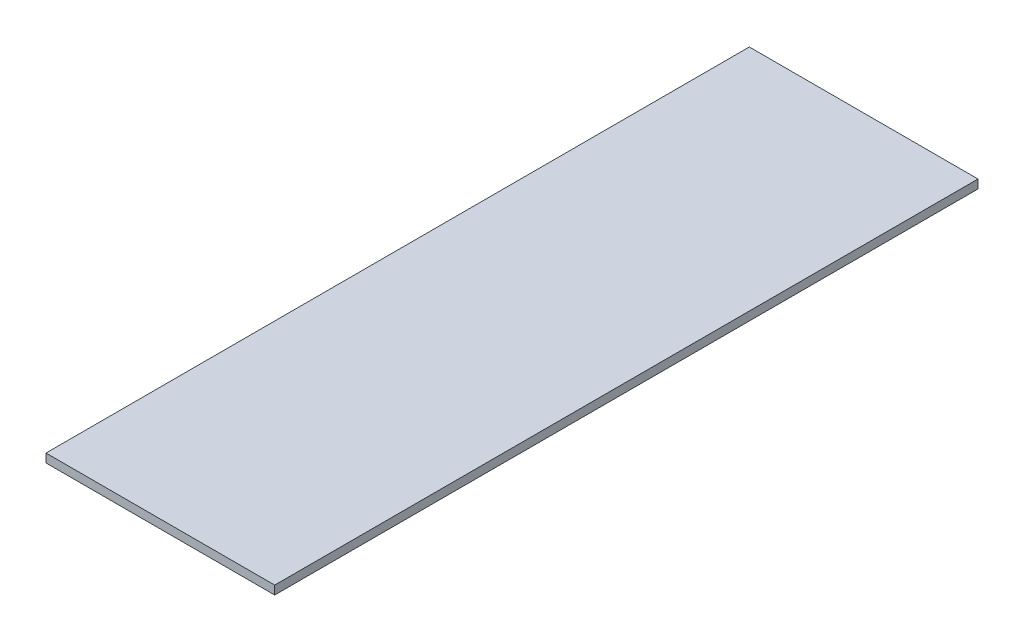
ISO-10303-21;
HEADER;
FILE_DESCRIPTION(('STEP AP214'),'2;1');
FILE_NAME('part.step','',(''),(''),'','','');
FILE_SCHEMA(('AUTOMOTIVE_DESIGN { 1 0 10303 214 1 1 1 1 }'));
ENDSEC;
DATA;
#1=APPLICATION_CONTEXT('core data for automotive mechanical design processes');
#2=APPLICATION_PROTOCOL_DEFINITION('international standard','automotive_design',2000,#1);
#3=PRODUCT_CONTEXT('',#1,'mechanical');
#4=PRODUCT('Part','Part','',(#3));
#5=PRODUCT_RELATED_PRODUCT_CATEGORY('part','',(#4));
#6=PRODUCT_DEFINITION_FORMATION('','',#4);
#7=PRODUCT_DEFINITION_CONTEXT('part definition',#1,'design');
#8=PRODUCT_DEFINITION('design','',#6,#7);
#9=PRODUCT_DEFINITION_SHAPE('','',#8);
#10=(LENGTH_UNIT() NAMED_UNIT(*) SI_UNIT(.MILLI.,.METRE.));
#11=(NAMED_UNIT(*) PLANE_ANGLE_UNIT() SI_UNIT($,.RADIAN.));
#12=(NAMED_UNIT(*) SI_UNIT($,.STERADIAN.) SOLID_ANGLE_UNIT());
#13=UNCERTAINTY_MEASURE_WITH_UNIT(LENGTH_MEASURE(1.E-05),#10,'distance_accuracy_value','');
#14=(GEOMETRIC_REPRESENTATION_CONTEXT(3) GLOBAL_UNCERTAINTY_ASSIGNED_CONTEXT((#13)) GLOBAL_UNIT_ASSIGNED_CONTEXT((#10,
#11,#12)) REPRESENTATION_CONTEXT('',''));
#15=CARTESIAN_POINT('',(0.,0.,0.));
#16=DIRECTION('',(0.,0.,1.));
#17=DIRECTION('',(1.,0.,0.));
#18=AXIS2_PLACEMENT_3D('',#15,#16,#17);
#19=CARTESIAN_POINT('',(265.,-10.,815.));
#20=DIRECTION('',(-1.,0.,0.));
#21=DIRECTION('',(0.,0.,1.));
#22=AXIS2_PLACEMENT_3D('',#19,#20,#21);
#23=PLANE('',#22);
#24=DIRECTION('',(0.,1.,0.));
#25=VECTOR('',#24,1.);
#26=CARTESIAN_POINT('',(265.,-10.,-815.));
#27=LINE('',#26,#25);
#28=CARTESIAN_POINT('',(265.,-10.,-815.));
#29=VERTEX_POINT('',#28);
#30=CARTESIAN_POINT('',(265.,10.,-815.));
#31=VERTEX_POINT('',#30);
#32=EDGE_CURVE('E106',#29,#31,#27,.T.);
#33=ORIENTED_EDGE('',*,*,#32,.T.);
#34=DIRECTION('',(0.,0.,-1.));
#35=VECTOR('',#34,1.);
#36=CARTESIAN_POINT('',(265.,10.,815.));
#37=LINE('',#36,#35);
#38=CARTESIAN_POINT('',(265.,10.,815.));
#39=VERTEX_POINT('',#38);
#40=EDGE_CURVE('E11',#39,#31,#37,.T.);
#41=ORIENTED_EDGE('',*,*,#40,.F.);
#42=DIRECTION('',(0.,1.,0.));
#43=VECTOR('',#42,1.);
#44=CARTESIAN_POINT('',(265.,-10.,815.));
#45=LINE('',#44,#43);
#46=CARTESIAN_POINT('',(265.,-10.,815.));
#47=VERTEX_POINT('',#46);
#48=EDGE_CURVE('E94',#47,#39,#45,.T.);
#49=ORIENTED_EDGE('',*,*,#48,.F.);
#50=DIRECTION('',(0.,0.,-1.));
#51=VECTOR('',#50,1.);
#52=CARTESIAN_POINT('',(265.,-10.,815.));
#53=LINE('',#52,#51);
#54=EDGE_CURVE('E102',#47,#29,#53,.T.);
#55=ORIENTED_EDGE('',*,*,#54,.T.);
#56=EDGE_LOOP('',(#33,#41,#49,#55));
#57=FACE_BOUND('',#56,.T.);
#58=ADVANCED_FACE('F43',(#57),#23,.F.);
#59=CARTESIAN_POINT('',(-265.,10.,815.));
#60=DIRECTION('',(0.,-1.,0.));
#61=DIRECTION('',(0.,0.,-1.));
#62=AXIS2_PLACEMENT_3D('',#59,#60,#61);
#63=PLANE('',#62);
#64=DIRECTION('',(-1.,0.,0.));
#65=VECTOR('',#64,1.);
#66=CARTESIAN_POINT('',(-265.,10.,-815.));
#67=LINE('',#66,#65);
#68=CARTESIAN_POINT('',(-265.,10.,-815.));
#69=VERTEX_POINT('',#68);
#70=EDGE_CURVE('E98',#31,#69,#67,.T.);
#71=ORIENTED_EDGE('',*,*,#70,.T.);
#72=DIRECTION('',(0.,0.,-1.));
#73=VECTOR('',#72,1.);
#74=CARTESIAN_POINT('',(-265.,10.,815.));
#75=LINE('',#74,#73);
#76=CARTESIAN_POINT('',(-265.,10.,815.));
#77=VERTEX_POINT('',#76);
#78=EDGE_CURVE('E51',#77,#69,#75,.T.);
#79=ORIENTED_EDGE('',*,*,#78,.F.);
#80=DIRECTION('',(-1.,0.,0.));
#81=VECTOR('',#80,1.);
#82=CARTESIAN_POINT('',(-265.,10.,815.));
#83=LINE('',#82,#81);
#84=EDGE_CURVE('E89',#39,#77,#83,.T.);
#85=ORIENTED_EDGE('',*,*,#84,.F.);
#86=ORIENTED_EDGE('',*,*,#40,.T.);
#87=EDGE_LOOP('',(#71,#79,#85,#86));
#88=FACE_BOUND('',#87,.T.);
#89=ADVANCED_FACE('F97',(#88),#63,.F.);
#90=CARTESIAN_POINT('',(-265.,-10.,815.));
#91=DIRECTION('',(1.,0.,0.));
#92=DIRECTION('',(0.,0.,-1.));
#93=AXIS2_PLACEMENT_3D('',#90,#91,#92);
#94=PLANE('',#93);
#95=DIRECTION('',(0.,-1.,0.));
#96=VECTOR('',#95,1.);
#97=CARTESIAN_POINT('',(-265.,-10.,-815.));
#98=LINE('',#97,#96);
#99=CARTESIAN_POINT('',(-265.,-10.,-815.));
#100=VERTEX_POINT('',#99);
#101=EDGE_CURVE('E76',#69,#100,#98,.T.);
#102=ORIENTED_EDGE('',*,*,#101,.T.);
#103=DIRECTION('',(0.,0.,-1.));
#104=VECTOR('',#103,1.);
#105=CARTESIAN_POINT('',(-265.,-10.,815.));
#106=LINE('',#105,#104);
#107=CARTESIAN_POINT('',(-265.,-10.,815.));
#108=VERTEX_POINT('',#107);
#109=EDGE_CURVE('E99',#108,#100,#106,.T.);
#110=ORIENTED_EDGE('',*,*,#109,.F.);
#111=DIRECTION('',(0.,-1.,0.));
#112=VECTOR('',#111,1.);
#113=CARTESIAN_POINT('',(-265.,-10.,815.));
#114=LINE('',#113,#112);
#115=EDGE_CURVE('E92',#77,#108,#114,.T.);
#116=ORIENTED_EDGE('',*,*,#115,.F.);
#117=ORIENTED_EDGE('',*,*,#78,.T.);
#118=EDGE_LOOP('',(#102,#110,#116,#117));
#119=FACE_BOUND('',#118,.T.);
#120=ADVANCED_FACE('F100',(#119),#94,.F.);
#121=CARTESIAN_POINT('',(-265.,-10.,815.));
#122=DIRECTION('',(0.,1.,0.));
#123=DIRECTION('',(0.,0.,1.));
#124=AXIS2_PLACEMENT_3D('',#121,#122,#123);
#125=PLANE('',#124);
#126=DIRECTION('',(1.,0.,0.));
#127=VECTOR('',#126,1.);
#128=CARTESIAN_POINT('',(-265.,-10.,-815.));
#129=LINE('',#128,#127);
#130=EDGE_CURVE('E82',#100,#29,#129,.T.);
#131=ORIENTED_EDGE('',*,*,#130,.T.);
#132=ORIENTED_EDGE('',*,*,#54,.F.);
#133=DIRECTION('',(1.,0.,0.));
#134=VECTOR('',#133,1.);
#135=CARTESIAN_POINT('',(-265.,-10.,815.));
#136=LINE('',#135,#134);
#137=EDGE_CURVE('E59',#108,#47,#136,.T.);
#138=ORIENTED_EDGE('',*,*,#137,.F.);
#139=ORIENTED_EDGE('',*,*,#109,.T.);
#140=EDGE_LOOP('',(#131,#132,#138,#139));
#141=FACE_BOUND('',#140,.T.);
#142=ADVANCED_FACE('F113',(#141),#125,.F.);
#143=CARTESIAN_POINT('',(0.,0.,815.));
#144=DIRECTION('',(0.,0.,-1.));
#145=DIRECTION('',(-1.,0.,0.));
#146=AXIS2_PLACEMENT_3D('',#143,#144,#145);
#147=PLANE('',#146);
#148=ORIENTED_EDGE('',*,*,#48,.T.);
#149=ORIENTED_EDGE('',*,*,#84,.T.);
#150=ORIENTED_EDGE('',*,*,#115,.T.);
#151=ORIENTED_EDGE('',*,*,#137,.T.);
#152=EDGE_LOOP('',(#148,#149,#150,#151));
#153=FACE_BOUND('',#152,.T.);
#154=ADVANCED_FACE('F90',(#153),#147,.F.);
#155=CARTESIAN_POINT('',(0.,0.,-815.));
#156=DIRECTION('',(0.,0.,-1.));
#157=DIRECTION('',(-1.,0.,0.));
#158=AXIS2_PLACEMENT_3D('',#155,#156,#157);
#159=PLANE('',#158);
#160=ORIENTED_EDGE('',*,*,#32,.F.);
#161=ORIENTED_EDGE('',*,*,#130,.F.);
#162=ORIENTED_EDGE('',*,*,#101,.F.);
#163=ORIENTED_EDGE('',*,*,#70,.F.);
#164=EDGE_LOOP('',(#160,#161,#162,#163));
#165=FACE_BOUND('',#164,.T.);
#166=ADVANCED_FACE('F116',(#165),#159,.T.);
#167=CLOSED_SHELL('',(#58,#89,#120,#142,#154,#166));
#168=MANIFOLD_SOLID_BREP('B2',#167);
#169=ADVANCED_BREP_SHAPE_REPRESENTATION('',(#18,#168),#14);
#170=SHAPE_DEFINITION_REPRESENTATION(#9,#169);
ENDSEC;
END-ISO-10303-21;
